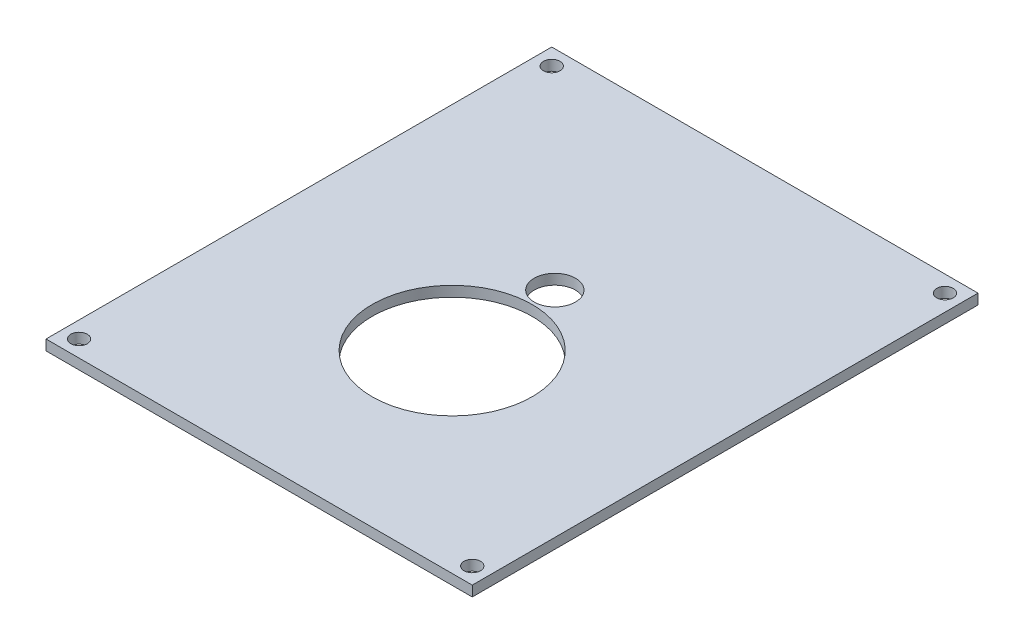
ISO-10303-21;
HEADER;
FILE_DESCRIPTION(('STEP AP214'),'2;1');
FILE_NAME('part.step','',(''),(''),'','','');
FILE_SCHEMA(('AUTOMOTIVE_DESIGN { 1 0 10303 214 1 1 1 1 }'));
ENDSEC;
DATA;
#1=APPLICATION_CONTEXT('core data for automotive mechanical design processes');
#2=APPLICATION_PROTOCOL_DEFINITION('international standard','automotive_design',2000,#1);
#3=PRODUCT_CONTEXT('',#1,'mechanical');
#4=PRODUCT('Part','Part','',(#3));
#5=PRODUCT_RELATED_PRODUCT_CATEGORY('part','',(#4));
#6=PRODUCT_DEFINITION_FORMATION('','',#4);
#7=PRODUCT_DEFINITION_CONTEXT('part definition',#1,'design');
#8=PRODUCT_DEFINITION('design','',#6,#7);
#9=PRODUCT_DEFINITION_SHAPE('','',#8);
#10=(LENGTH_UNIT() NAMED_UNIT(*) SI_UNIT(.MILLI.,.METRE.));
#11=(NAMED_UNIT(*) PLANE_ANGLE_UNIT() SI_UNIT($,.RADIAN.));
#12=(NAMED_UNIT(*) SI_UNIT($,.STERADIAN.) SOLID_ANGLE_UNIT());
#13=UNCERTAINTY_MEASURE_WITH_UNIT(LENGTH_MEASURE(1.E-05),#10,'distance_accuracy_value','');
#14=(GEOMETRIC_REPRESENTATION_CONTEXT(3) GLOBAL_UNCERTAINTY_ASSIGNED_CONTEXT((#13)) GLOBAL_UNIT_ASSIGNED_CONTEXT((#10,
#11,#12)) REPRESENTATION_CONTEXT('',''));
#15=CARTESIAN_POINT('',(0.,0.,0.));
#16=DIRECTION('',(0.,0.,1.));
#17=DIRECTION('',(1.,0.,0.));
#18=AXIS2_PLACEMENT_3D('',#15,#16,#17);
#19=CARTESIAN_POINT('',(-41.3,2.,-49.));
#20=DIRECTION('',(1.,0.,0.));
#21=DIRECTION('',(0.,0.,-1.));
#22=AXIS2_PLACEMENT_3D('',#19,#20,#21);
#23=PLANE('',#22);
#24=DIRECTION('',(0.,0.,1.));
#25=VECTOR('',#24,1.);
#26=CARTESIAN_POINT('',(-41.3,0.,-49.));
#27=LINE('',#26,#25);
#28=CARTESIAN_POINT('',(-41.3,0.,-49.));
#29=VERTEX_POINT('',#28);
#30=CARTESIAN_POINT('',(-41.3,0.,49.));
#31=VERTEX_POINT('',#30);
#32=EDGE_CURVE('E95',#29,#31,#27,.T.);
#33=ORIENTED_EDGE('',*,*,#32,.T.);
#34=DIRECTION('',(0.,-1.,0.));
#35=VECTOR('',#34,1.);
#36=CARTESIAN_POINT('',(-41.3,2.,49.));
#37=LINE('',#36,#35);
#38=CARTESIAN_POINT('',(-41.3,2.,49.));
#39=VERTEX_POINT('',#38);
#40=EDGE_CURVE('E11',#39,#31,#37,.T.);
#41=ORIENTED_EDGE('',*,*,#40,.F.);
#42=DIRECTION('',(0.,0.,1.));
#43=VECTOR('',#42,1.);
#44=CARTESIAN_POINT('',(-41.3,2.,-49.));
#45=LINE('',#44,#43);
#46=CARTESIAN_POINT('',(-41.3,2.,-49.));
#47=VERTEX_POINT('',#46);
#48=EDGE_CURVE('E83',#47,#39,#45,.T.);
#49=ORIENTED_EDGE('',*,*,#48,.F.);
#50=DIRECTION('',(0.,-1.,0.));
#51=VECTOR('',#50,1.);
#52=CARTESIAN_POINT('',(-41.3,2.,-49.));
#53=LINE('',#52,#51);
#54=EDGE_CURVE('E91',#47,#29,#53,.T.);
#55=ORIENTED_EDGE('',*,*,#54,.T.);
#56=EDGE_LOOP('',(#33,#41,#49,#55));
#57=FACE_BOUND('',#56,.T.);
#58=ADVANCED_FACE('F32',(#57),#23,.F.);
#59=CARTESIAN_POINT('',(41.3,2.,49.));
#60=DIRECTION('',(0.,0.,-1.));
#61=DIRECTION('',(-1.,0.,0.));
#62=AXIS2_PLACEMENT_3D('',#59,#60,#61);
#63=PLANE('',#62);
#64=DIRECTION('',(1.,0.,0.));
#65=VECTOR('',#64,1.);
#66=CARTESIAN_POINT('',(41.3,0.,49.));
#67=LINE('',#66,#65);
#68=CARTESIAN_POINT('',(41.3,0.,49.));
#69=VERTEX_POINT('',#68);
#70=EDGE_CURVE('E87',#31,#69,#67,.T.);
#71=ORIENTED_EDGE('',*,*,#70,.T.);
#72=DIRECTION('',(0.,-1.,0.));
#73=VECTOR('',#72,1.);
#74=CARTESIAN_POINT('',(41.3,2.,49.));
#75=LINE('',#74,#73);
#76=CARTESIAN_POINT('',(41.3,2.,49.));
#77=VERTEX_POINT('',#76);
#78=EDGE_CURVE('E40',#77,#69,#75,.T.);
#79=ORIENTED_EDGE('',*,*,#78,.F.);
#80=DIRECTION('',(1.,0.,0.));
#81=VECTOR('',#80,1.);
#82=CARTESIAN_POINT('',(41.3,2.,49.));
#83=LINE('',#82,#81);
#84=EDGE_CURVE('E78',#39,#77,#83,.T.);
#85=ORIENTED_EDGE('',*,*,#84,.F.);
#86=ORIENTED_EDGE('',*,*,#40,.T.);
#87=EDGE_LOOP('',(#71,#79,#85,#86));
#88=FACE_BOUND('',#87,.T.);
#89=ADVANCED_FACE('F86',(#88),#63,.F.);
#90=CARTESIAN_POINT('',(41.3,2.,-49.));
#91=DIRECTION('',(-1.,0.,0.));
#92=DIRECTION('',(0.,0.,1.));
#93=AXIS2_PLACEMENT_3D('',#90,#91,#92);
#94=PLANE('',#93);
#95=DIRECTION('',(0.,0.,-1.));
#96=VECTOR('',#95,1.);
#97=CARTESIAN_POINT('',(41.3,0.,-49.));
#98=LINE('',#97,#96);
#99=CARTESIAN_POINT('',(41.3,0.,-49.));
#100=VERTEX_POINT('',#99);
#101=EDGE_CURVE('E65',#69,#100,#98,.T.);
#102=ORIENTED_EDGE('',*,*,#101,.T.);
#103=DIRECTION('',(0.,-1.,0.));
#104=VECTOR('',#103,1.);
#105=CARTESIAN_POINT('',(41.3,2.,-49.));
#106=LINE('',#105,#104);
#107=CARTESIAN_POINT('',(41.3,2.,-49.));
#108=VERTEX_POINT('',#107);
#109=EDGE_CURVE('E88',#108,#100,#106,.T.);
#110=ORIENTED_EDGE('',*,*,#109,.F.);
#111=DIRECTION('',(0.,0.,-1.));
#112=VECTOR('',#111,1.);
#113=CARTESIAN_POINT('',(41.3,2.,-49.));
#114=LINE('',#113,#112);
#115=EDGE_CURVE('E81',#77,#108,#114,.T.);
#116=ORIENTED_EDGE('',*,*,#115,.F.);
#117=ORIENTED_EDGE('',*,*,#78,.T.);
#118=EDGE_LOOP('',(#102,#110,#116,#117));
#119=FACE_BOUND('',#118,.T.);
#120=ADVANCED_FACE('F89',(#119),#94,.F.);
#121=CARTESIAN_POINT('',(41.3,2.,-49.));
#122=DIRECTION('',(0.,0.,1.));
#123=DIRECTION('',(1.,0.,0.));
#124=AXIS2_PLACEMENT_3D('',#121,#122,#123);
#125=PLANE('',#124);
#126=DIRECTION('',(-1.,0.,0.));
#127=VECTOR('',#126,1.);
#128=CARTESIAN_POINT('',(41.3,0.,-49.));
#129=LINE('',#128,#127);
#130=EDGE_CURVE('E71',#100,#29,#129,.T.);
#131=ORIENTED_EDGE('',*,*,#130,.T.);
#132=ORIENTED_EDGE('',*,*,#54,.F.);
#133=DIRECTION('',(-1.,0.,0.));
#134=VECTOR('',#133,1.);
#135=CARTESIAN_POINT('',(41.3,2.,-49.));
#136=LINE('',#135,#134);
#137=EDGE_CURVE('E48',#108,#47,#136,.T.);
#138=ORIENTED_EDGE('',*,*,#137,.F.);
#139=ORIENTED_EDGE('',*,*,#109,.T.);
#140=EDGE_LOOP('',(#131,#132,#138,#139));
#141=FACE_BOUND('',#140,.T.);
#142=ADVANCED_FACE('F103',(#141),#125,.F.);
#143=CARTESIAN_POINT('',(0.,2.,0.));
#144=DIRECTION('',(0.,-1.,0.));
#145=DIRECTION('',(0.,0.,-1.));
#146=AXIS2_PLACEMENT_3D('',#143,#144,#145);
#147=PLANE('',#146);
#148=CARTESIAN_POINT('',(-0.199999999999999,2.,-8.5));
#149=DIRECTION('',(0.,-1.,0.));
#150=DIRECTION('',(0.,0.,-1.));
#151=AXIS2_PLACEMENT_3D('',#148,#149,#150);
#152=CIRCLE('',#151,4.);
#153=CARTESIAN_POINT('',(-0.199999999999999,2.,-12.5));
#154=VERTEX_POINT('',#153);
#155=EDGE_CURVE('E136',#154,#154,#152,.T.);
#156=ORIENTED_EDGE('',*,*,#155,.T.);
#157=EDGE_LOOP('',(#156));
#158=FACE_BOUND('',#157,.T.);
#159=CARTESIAN_POINT('',(0.,2.,11.6));
#160=DIRECTION('',(0.,1.,0.));
#161=DIRECTION('',(0.,0.,1.));
#162=AXIS2_PLACEMENT_3D('',#159,#160,#161);
#163=CIRCLE('',#162,15.5);
#164=CARTESIAN_POINT('',(0.,2.,27.1));
#165=VERTEX_POINT('',#164);
#166=EDGE_CURVE('E133',#165,#165,#163,.T.);
#167=ORIENTED_EDGE('',*,*,#166,.F.);
#168=EDGE_LOOP('',(#167));
#169=FACE_BOUND('',#168,.T.);
#170=CARTESIAN_POINT('',(-38.1,2.,-45.8));
#171=DIRECTION('',(0.,1.,0.));
#172=DIRECTION('',(0.,0.,1.));
#173=AXIS2_PLACEMENT_3D('',#170,#171,#172);
#174=CIRCLE('',#173,1.59999999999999);
#175=CARTESIAN_POINT('',(-38.1,2.,-44.2));
#176=VERTEX_POINT('',#175);
#177=EDGE_CURVE('E129',#176,#176,#174,.T.);
#178=ORIENTED_EDGE('',*,*,#177,.F.);
#179=EDGE_LOOP('',(#178));
#180=FACE_BOUND('',#179,.T.);
#181=CARTESIAN_POINT('',(38.1,2.,-45.8));
#182=DIRECTION('',(0.,1.,0.));
#183=DIRECTION('',(0.,0.,1.));
#184=AXIS2_PLACEMENT_3D('',#181,#182,#183);
#185=CIRCLE('',#184,1.59999999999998);
#186=CARTESIAN_POINT('',(38.1,2.,-44.2));
#187=VERTEX_POINT('',#186);
#188=EDGE_CURVE('E123',#187,#187,#185,.T.);
#189=ORIENTED_EDGE('',*,*,#188,.F.);
#190=EDGE_LOOP('',(#189));
#191=FACE_BOUND('',#190,.T.);
#192=CARTESIAN_POINT('',(38.1,2.,45.8));
#193=DIRECTION('',(0.,1.,0.));
#194=DIRECTION('',(0.,0.,1.));
#195=AXIS2_PLACEMENT_3D('',#192,#193,#194);
#196=CIRCLE('',#195,1.59999999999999);
#197=CARTESIAN_POINT('',(38.1,2.,47.4));
#198=VERTEX_POINT('',#197);
#199=EDGE_CURVE('E117',#198,#198,#196,.T.);
#200=ORIENTED_EDGE('',*,*,#199,.F.);
#201=EDGE_LOOP('',(#200));
#202=FACE_BOUND('',#201,.T.);
#203=CARTESIAN_POINT('',(-38.1,2.,45.8));
#204=DIRECTION('',(0.,1.,0.));
#205=DIRECTION('',(0.,0.,1.));
#206=AXIS2_PLACEMENT_3D('',#203,#204,#205);
#207=CIRCLE('',#206,1.59999999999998);
#208=CARTESIAN_POINT('',(-38.1,2.,47.4));
#209=VERTEX_POINT('',#208);
#210=EDGE_CURVE('E111',#209,#209,#207,.T.);
#211=ORIENTED_EDGE('',*,*,#210,.F.);
#212=EDGE_LOOP('',(#211));
#213=FACE_BOUND('',#212,.T.);
#214=ORIENTED_EDGE('',*,*,#48,.T.);
#215=ORIENTED_EDGE('',*,*,#84,.T.);
#216=ORIENTED_EDGE('',*,*,#115,.T.);
#217=ORIENTED_EDGE('',*,*,#137,.T.);
#218=EDGE_LOOP('',(#214,#215,#216,#217));
#219=FACE_BOUND('',#218,.T.);
#220=ADVANCED_FACE('F79',(#158,#169,#180,#191,#202,#213,#219),#147,.F.);
#221=CARTESIAN_POINT('',(0.,0.,0.));
#222=DIRECTION('',(0.,-1.,0.));
#223=DIRECTION('',(0.,0.,-1.));
#224=AXIS2_PLACEMENT_3D('',#221,#222,#223);
#225=PLANE('',#224);
#226=CARTESIAN_POINT('',(-0.199999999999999,0.,-8.5));
#227=DIRECTION('',(0.,-1.,0.));
#228=DIRECTION('',(0.,0.,-1.));
#229=AXIS2_PLACEMENT_3D('',#226,#227,#228);
#230=CIRCLE('',#229,4.);
#231=CARTESIAN_POINT('',(-0.199999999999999,0.,-12.5));
#232=VERTEX_POINT('',#231);
#233=EDGE_CURVE('E141',#232,#232,#230,.T.);
#234=ORIENTED_EDGE('',*,*,#233,.F.);
#235=EDGE_LOOP('',(#234));
#236=FACE_BOUND('',#235,.T.);
#237=CARTESIAN_POINT('',(0.,0.,11.6));
#238=DIRECTION('',(0.,1.,0.));
#239=DIRECTION('',(0.,0.,1.));
#240=AXIS2_PLACEMENT_3D('',#237,#238,#239);
#241=CIRCLE('',#240,15.5);
#242=CARTESIAN_POINT('',(0.,0.,27.1));
#243=VERTEX_POINT('',#242);
#244=EDGE_CURVE('E132',#243,#243,#241,.T.);
#245=ORIENTED_EDGE('',*,*,#244,.T.);
#246=EDGE_LOOP('',(#245));
#247=FACE_BOUND('',#246,.T.);
#248=CARTESIAN_POINT('',(-38.1,0.,-45.8));
#249=DIRECTION('',(0.,1.,0.));
#250=DIRECTION('',(0.,0.,1.));
#251=AXIS2_PLACEMENT_3D('',#248,#249,#250);
#252=CIRCLE('',#251,1.59999999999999);
#253=CARTESIAN_POINT('',(-38.1,0.,-44.2));
#254=VERTEX_POINT('',#253);
#255=EDGE_CURVE('E126',#254,#254,#252,.T.);
#256=ORIENTED_EDGE('',*,*,#255,.T.);
#257=EDGE_LOOP('',(#256));
#258=FACE_BOUND('',#257,.T.);
#259=CARTESIAN_POINT('',(38.1,0.,-45.8));
#260=DIRECTION('',(0.,1.,0.));
#261=DIRECTION('',(0.,0.,1.));
#262=AXIS2_PLACEMENT_3D('',#259,#260,#261);
#263=CIRCLE('',#262,1.59999999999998);
#264=CARTESIAN_POINT('',(38.1,0.,-44.2));
#265=VERTEX_POINT('',#264);
#266=EDGE_CURVE('E120',#265,#265,#263,.T.);
#267=ORIENTED_EDGE('',*,*,#266,.T.);
#268=EDGE_LOOP('',(#267));
#269=FACE_BOUND('',#268,.T.);
#270=CARTESIAN_POINT('',(38.1,0.,45.8));
#271=DIRECTION('',(0.,1.,0.));
#272=DIRECTION('',(0.,0.,1.));
#273=AXIS2_PLACEMENT_3D('',#270,#271,#272);
#274=CIRCLE('',#273,1.59999999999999);
#275=CARTESIAN_POINT('',(38.1,0.,47.4));
#276=VERTEX_POINT('',#275);
#277=EDGE_CURVE('E114',#276,#276,#274,.T.);
#278=ORIENTED_EDGE('',*,*,#277,.T.);
#279=EDGE_LOOP('',(#278));
#280=FACE_BOUND('',#279,.T.);
#281=CARTESIAN_POINT('',(-38.1,0.,45.8));
#282=DIRECTION('',(0.,1.,0.));
#283=DIRECTION('',(0.,0.,1.));
#284=AXIS2_PLACEMENT_3D('',#281,#282,#283);
#285=CIRCLE('',#284,1.59999999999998);
#286=CARTESIAN_POINT('',(-38.1,0.,47.4));
#287=VERTEX_POINT('',#286);
#288=EDGE_CURVE('E98',#287,#287,#285,.T.);
#289=ORIENTED_EDGE('',*,*,#288,.T.);
#290=EDGE_LOOP('',(#289));
#291=FACE_BOUND('',#290,.T.);
#292=ORIENTED_EDGE('',*,*,#32,.F.);
#293=ORIENTED_EDGE('',*,*,#130,.F.);
#294=ORIENTED_EDGE('',*,*,#101,.F.);
#295=ORIENTED_EDGE('',*,*,#70,.F.);
#296=EDGE_LOOP('',(#292,#293,#294,#295));
#297=FACE_BOUND('',#296,.T.);
#298=ADVANCED_FACE('F106',(#236,#247,#258,#269,#280,#291,#297),#225,.T.);
#299=CARTESIAN_POINT('',(-38.1,2.,45.8));
#300=DIRECTION('',(0.,1.,0.));
#301=DIRECTION('',(0.,0.,1.));
#302=AXIS2_PLACEMENT_3D('',#299,#300,#301);
#303=CYLINDRICAL_SURFACE('',#302,1.59999999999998);
#304=ORIENTED_EDGE('',*,*,#288,.F.);
#305=EDGE_LOOP('',(#304));
#306=FACE_BOUND('',#305,.T.);
#307=ORIENTED_EDGE('',*,*,#210,.T.);
#308=EDGE_LOOP('',(#307));
#309=FACE_BOUND('',#308,.T.);
#310=ADVANCED_FACE('F150',(#306,#309),#303,.F.);
#311=CARTESIAN_POINT('',(38.1,2.,45.8));
#312=DIRECTION('',(0.,1.,0.));
#313=DIRECTION('',(0.,0.,1.));
#314=AXIS2_PLACEMENT_3D('',#311,#312,#313);
#315=CYLINDRICAL_SURFACE('',#314,1.59999999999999);
#316=ORIENTED_EDGE('',*,*,#277,.F.);
#317=EDGE_LOOP('',(#316));
#318=FACE_BOUND('',#317,.T.);
#319=ORIENTED_EDGE('',*,*,#199,.T.);
#320=EDGE_LOOP('',(#319));
#321=FACE_BOUND('',#320,.T.);
#322=ADVANCED_FACE('F164',(#318,#321),#315,.F.);
#323=CARTESIAN_POINT('',(38.1,2.,-45.8));
#324=DIRECTION('',(0.,1.,0.));
#325=DIRECTION('',(0.,0.,1.));
#326=AXIS2_PLACEMENT_3D('',#323,#324,#325);
#327=CYLINDRICAL_SURFACE('',#326,1.59999999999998);
#328=ORIENTED_EDGE('',*,*,#266,.F.);
#329=EDGE_LOOP('',(#328));
#330=FACE_BOUND('',#329,.T.);
#331=ORIENTED_EDGE('',*,*,#188,.T.);
#332=EDGE_LOOP('',(#331));
#333=FACE_BOUND('',#332,.T.);
#334=ADVANCED_FACE('F212',(#330,#333),#327,.F.);
#335=CARTESIAN_POINT('',(-38.1,2.,-45.8));
#336=DIRECTION('',(0.,1.,0.));
#337=DIRECTION('',(0.,0.,1.));
#338=AXIS2_PLACEMENT_3D('',#335,#336,#337);
#339=CYLINDRICAL_SURFACE('',#338,1.59999999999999);
#340=ORIENTED_EDGE('',*,*,#255,.F.);
#341=EDGE_LOOP('',(#340));
#342=FACE_BOUND('',#341,.T.);
#343=ORIENTED_EDGE('',*,*,#177,.T.);
#344=EDGE_LOOP('',(#343));
#345=FACE_BOUND('',#344,.T.);
#346=ADVANCED_FACE('F220',(#342,#345),#339,.F.);
#347=CARTESIAN_POINT('',(0.,0.,11.6));
#348=DIRECTION('',(0.,1.,0.));
#349=DIRECTION('',(0.,0.,1.));
#350=AXIS2_PLACEMENT_3D('',#347,#348,#349);
#351=CYLINDRICAL_SURFACE('',#350,15.5);
#352=ORIENTED_EDGE('',*,*,#244,.F.);
#353=EDGE_LOOP('',(#352));
#354=FACE_BOUND('',#353,.T.);
#355=ORIENTED_EDGE('',*,*,#166,.T.);
#356=EDGE_LOOP('',(#355));
#357=FACE_BOUND('',#356,.T.);
#358=ADVANCED_FACE('F228',(#354,#357),#351,.F.);
#359=CARTESIAN_POINT('',(-0.199999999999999,10.,-8.5));
#360=DIRECTION('',(0.,-1.,0.));
#361=DIRECTION('',(0.,0.,-1.));
#362=AXIS2_PLACEMENT_3D('',#359,#360,#361);
#363=CYLINDRICAL_SURFACE('',#362,4.);
#364=ORIENTED_EDGE('',*,*,#233,.T.);
#365=EDGE_LOOP('',(#364));
#366=FACE_BOUND('',#365,.T.);
#367=ORIENTED_EDGE('',*,*,#155,.F.);
#368=EDGE_LOOP('',(#367));
#369=FACE_BOUND('',#368,.T.);
#370=ADVANCED_FACE('F145',(#366,#369),#363,.F.);
#371=CLOSED_SHELL('',(#58,#89,#120,#142,#220,#298,#310,#322,#334,#346,#358,#370));
#372=MANIFOLD_SOLID_BREP('B2',#371);
#373=ADVANCED_BREP_SHAPE_REPRESENTATION('',(#18,#372),#14);
#374=SHAPE_DEFINITION_REPRESENTATION(#9,#373);
ENDSEC;
END-ISO-10303-21;
